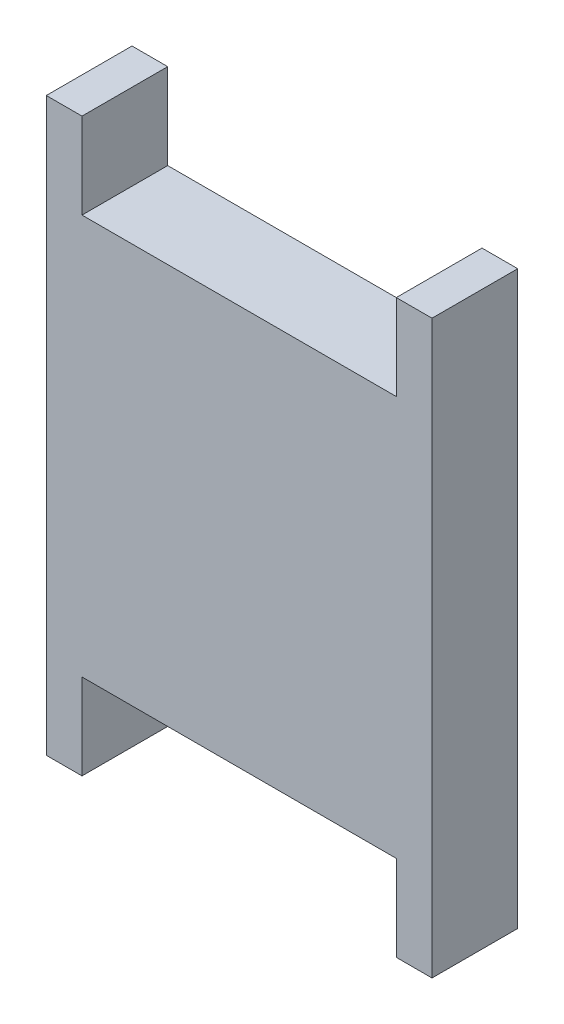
ISO-10303-21;
HEADER;
FILE_DESCRIPTION(('STEP AP214'),'2;1');
FILE_NAME('part.step','',(''),(''),'','','');
FILE_SCHEMA(('AUTOMOTIVE_DESIGN { 1 0 10303 214 1 1 1 1 }'));
ENDSEC;
DATA;
#1=APPLICATION_CONTEXT('core data for automotive mechanical design processes');
#2=APPLICATION_PROTOCOL_DEFINITION('international standard','automotive_design',2000,#1);
#3=PRODUCT_CONTEXT('',#1,'mechanical');
#4=PRODUCT('Part','Part','',(#3));
#5=PRODUCT_RELATED_PRODUCT_CATEGORY('part','',(#4));
#6=PRODUCT_DEFINITION_FORMATION('','',#4);
#7=PRODUCT_DEFINITION_CONTEXT('part definition',#1,'design');
#8=PRODUCT_DEFINITION('design','',#6,#7);
#9=PRODUCT_DEFINITION_SHAPE('','',#8);
#10=(LENGTH_UNIT() NAMED_UNIT(*) SI_UNIT(.MILLI.,.METRE.));
#11=(NAMED_UNIT(*) PLANE_ANGLE_UNIT() SI_UNIT($,.RADIAN.));
#12=(NAMED_UNIT(*) SI_UNIT($,.STERADIAN.) SOLID_ANGLE_UNIT());
#13=UNCERTAINTY_MEASURE_WITH_UNIT(LENGTH_MEASURE(1.E-05),#10,'distance_accuracy_value','');
#14=(GEOMETRIC_REPRESENTATION_CONTEXT(3) GLOBAL_UNCERTAINTY_ASSIGNED_CONTEXT((#13)) GLOBAL_UNIT_ASSIGNED_CONTEXT((#10,
#11,#12)) REPRESENTATION_CONTEXT('',''));
#15=CARTESIAN_POINT('',(0.,0.,0.));
#16=DIRECTION('',(0.,0.,1.));
#17=DIRECTION('',(1.,0.,0.));
#18=AXIS2_PLACEMENT_3D('',#15,#16,#17);
#19=CARTESIAN_POINT('',(42.8625,0.,19.05));
#20=DIRECTION('',(0.,1.,0.));
#21=DIRECTION('',(0.,0.,1.));
#22=AXIS2_PLACEMENT_3D('',#19,#20,#21);
#23=PLANE('',#22);
#24=DIRECTION('',(1.,0.,0.));
#25=VECTOR('',#24,1.);
#26=CARTESIAN_POINT('',(42.8625,0.,0.));
#27=LINE('',#26,#25);
#28=CARTESIAN_POINT('',(7.9375,0.,0.));
#29=VERTEX_POINT('',#28);
#30=CARTESIAN_POINT('',(77.7875,0.,0.));
#31=VERTEX_POINT('',#30);
#32=EDGE_CURVE('E154',#29,#31,#27,.T.);
#33=ORIENTED_EDGE('',*,*,#32,.T.);
#34=DIRECTION('',(0.,0.,-1.));
#35=VECTOR('',#34,1.);
#36=CARTESIAN_POINT('',(77.7875,0.,19.05));
#37=LINE('',#36,#35);
#38=CARTESIAN_POINT('',(77.7875,0.,19.05));
#39=VERTEX_POINT('',#38);
#40=EDGE_CURVE('E11',#39,#31,#37,.T.);
#41=ORIENTED_EDGE('',*,*,#40,.F.);
#42=DIRECTION('',(1.,0.,0.));
#43=VECTOR('',#42,1.);
#44=CARTESIAN_POINT('',(42.8625,0.,19.05));
#45=LINE('',#44,#43);
#46=CARTESIAN_POINT('',(7.9375,0.,19.05));
#47=VERTEX_POINT('',#46);
#48=EDGE_CURVE('E100',#47,#39,#45,.T.);
#49=ORIENTED_EDGE('',*,*,#48,.F.);
#50=DIRECTION('',(0.,0.,-1.));
#51=VECTOR('',#50,1.);
#52=CARTESIAN_POINT('',(7.9375,0.,19.05));
#53=LINE('',#52,#51);
#54=EDGE_CURVE('E153',#47,#29,#53,.T.);
#55=ORIENTED_EDGE('',*,*,#54,.T.);
#56=EDGE_LOOP('',(#33,#41,#49,#55));
#57=FACE_BOUND('',#56,.T.);
#58=ADVANCED_FACE('F33',(#57),#23,.F.);
#59=CARTESIAN_POINT('',(77.7875,-74.8721842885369,19.05));
#60=DIRECTION('',(-1.,0.,0.));
#61=DIRECTION('',(0.,0.,1.));
#62=AXIS2_PLACEMENT_3D('',#59,#60,#61);
#63=PLANE('',#62);
#64=DIRECTION('',(0.,1.,0.));
#65=VECTOR('',#64,1.);
#66=CARTESIAN_POINT('',(77.7875,-74.8721842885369,0.));
#67=LINE('',#66,#65);
#68=CARTESIAN_POINT('',(77.7875,-19.05,0.));
#69=VERTEX_POINT('',#68);
#70=EDGE_CURVE('E157',#69,#31,#67,.T.);
#71=ORIENTED_EDGE('',*,*,#70,.F.);
#72=DIRECTION('',(0.,0.,-1.));
#73=VECTOR('',#72,1.);
#74=CARTESIAN_POINT('',(77.7875,-19.05,19.05));
#75=LINE('',#74,#73);
#76=CARTESIAN_POINT('',(77.7875,-19.05,19.05));
#77=VERTEX_POINT('',#76);
#78=EDGE_CURVE('E41',#77,#69,#75,.T.);
#79=ORIENTED_EDGE('',*,*,#78,.F.);
#80=DIRECTION('',(0.,1.,0.));
#81=VECTOR('',#80,1.);
#82=CARTESIAN_POINT('',(77.7875,-74.8721842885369,19.05));
#83=LINE('',#82,#81);
#84=EDGE_CURVE('E413',#77,#39,#83,.T.);
#85=ORIENTED_EDGE('',*,*,#84,.T.);
#86=ORIENTED_EDGE('',*,*,#40,.T.);
#87=EDGE_LOOP('',(#71,#79,#85,#86));
#88=FACE_BOUND('',#87,.T.);
#89=ADVANCED_FACE('F207',(#88),#63,.T.);
#90=CARTESIAN_POINT('',(42.8625,-19.05,19.05));
#91=DIRECTION('',(0.,-1.,0.));
#92=DIRECTION('',(0.,0.,-1.));
#93=AXIS2_PLACEMENT_3D('',#90,#91,#92);
#94=PLANE('',#93);
#95=DIRECTION('',(-1.,0.,0.));
#96=VECTOR('',#95,1.);
#97=CARTESIAN_POINT('',(42.8625,-19.05,0.));
#98=LINE('',#97,#96);
#99=CARTESIAN_POINT('',(85.725,-19.05,0.));
#100=VERTEX_POINT('',#99);
#101=EDGE_CURVE('E160',#100,#69,#98,.T.);
#102=ORIENTED_EDGE('',*,*,#101,.F.);
#103=DIRECTION('',(0.,0.,-1.));
#104=VECTOR('',#103,1.);
#105=CARTESIAN_POINT('',(85.725,-19.05,19.05));
#106=LINE('',#105,#104);
#107=CARTESIAN_POINT('',(85.725,-19.05,19.05));
#108=VERTEX_POINT('',#107);
#109=EDGE_CURVE('E197',#108,#100,#106,.T.);
#110=ORIENTED_EDGE('',*,*,#109,.F.);
#111=DIRECTION('',(-1.,0.,0.));
#112=VECTOR('',#111,1.);
#113=CARTESIAN_POINT('',(42.8625,-19.05,19.05));
#114=LINE('',#113,#112);
#115=EDGE_CURVE('E204',#108,#77,#114,.T.);
#116=ORIENTED_EDGE('',*,*,#115,.T.);
#117=ORIENTED_EDGE('',*,*,#78,.T.);
#118=EDGE_LOOP('',(#102,#110,#116,#117));
#119=FACE_BOUND('',#118,.T.);
#120=ADVANCED_FACE('F202',(#119),#94,.T.);
#121=CARTESIAN_POINT('',(85.725,-74.8721842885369,19.05));
#122=DIRECTION('',(-1.,0.,0.));
#123=DIRECTION('',(0.,0.,1.));
#124=AXIS2_PLACEMENT_3D('',#121,#122,#123);
#125=PLANE('',#124);
#126=DIRECTION('',(0.,1.,0.));
#127=VECTOR('',#126,1.);
#128=CARTESIAN_POINT('',(85.725,-74.8721842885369,0.));
#129=LINE('',#128,#127);
#130=CARTESIAN_POINT('',(85.725,107.95,0.));
#131=VERTEX_POINT('',#130);
#132=EDGE_CURVE('E163',#100,#131,#129,.T.);
#133=ORIENTED_EDGE('',*,*,#132,.T.);
#134=DIRECTION('',(0.,0.,-1.));
#135=VECTOR('',#134,1.);
#136=CARTESIAN_POINT('',(85.725,107.95,19.05));
#137=LINE('',#136,#135);
#138=CARTESIAN_POINT('',(85.725,107.95,19.05));
#139=VERTEX_POINT('',#138);
#140=EDGE_CURVE('E194',#139,#131,#137,.T.);
#141=ORIENTED_EDGE('',*,*,#140,.F.);
#142=DIRECTION('',(0.,1.,0.));
#143=VECTOR('',#142,1.);
#144=CARTESIAN_POINT('',(85.725,-74.8721842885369,19.05));
#145=LINE('',#144,#143);
#146=EDGE_CURVE('E225',#108,#139,#145,.T.);
#147=ORIENTED_EDGE('',*,*,#146,.F.);
#148=ORIENTED_EDGE('',*,*,#109,.T.);
#149=EDGE_LOOP('',(#133,#141,#147,#148));
#150=FACE_BOUND('',#149,.T.);
#151=ADVANCED_FACE('F216',(#150),#125,.F.);
#152=CARTESIAN_POINT('',(42.8625,107.95,19.05));
#153=DIRECTION('',(0.,-1.,0.));
#154=DIRECTION('',(0.,0.,-1.));
#155=AXIS2_PLACEMENT_3D('',#152,#153,#154);
#156=PLANE('',#155);
#157=DIRECTION('',(-1.,0.,0.));
#158=VECTOR('',#157,1.);
#159=CARTESIAN_POINT('',(42.8625,107.95,0.));
#160=LINE('',#159,#158);
#161=CARTESIAN_POINT('',(77.7875,107.95,0.));
#162=VERTEX_POINT('',#161);
#163=EDGE_CURVE('E165',#131,#162,#160,.T.);
#164=ORIENTED_EDGE('',*,*,#163,.T.);
#165=DIRECTION('',(0.,0.,-1.));
#166=VECTOR('',#165,1.);
#167=CARTESIAN_POINT('',(77.7875,107.95,19.05));
#168=LINE('',#167,#166);
#169=CARTESIAN_POINT('',(77.7875,107.95,19.05));
#170=VERTEX_POINT('',#169);
#171=EDGE_CURVE('E191',#170,#162,#168,.T.);
#172=ORIENTED_EDGE('',*,*,#171,.F.);
#173=DIRECTION('',(-1.,0.,0.));
#174=VECTOR('',#173,1.);
#175=CARTESIAN_POINT('',(42.8625,107.95,19.05));
#176=LINE('',#175,#174);
#177=EDGE_CURVE('E222',#139,#170,#176,.T.);
#178=ORIENTED_EDGE('',*,*,#177,.F.);
#179=ORIENTED_EDGE('',*,*,#140,.T.);
#180=EDGE_LOOP('',(#164,#172,#178,#179));
#181=FACE_BOUND('',#180,.T.);
#182=ADVANCED_FACE('F220',(#181),#156,.F.);
#183=CARTESIAN_POINT('',(77.7875,-74.8721842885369,19.05));
#184=DIRECTION('',(1.,0.,0.));
#185=DIRECTION('',(0.,0.,-1.));
#186=AXIS2_PLACEMENT_3D('',#183,#184,#185);
#187=PLANE('',#186);
#188=DIRECTION('',(0.,-1.,0.));
#189=VECTOR('',#188,1.);
#190=CARTESIAN_POINT('',(77.7875,-74.8721842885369,0.));
#191=LINE('',#190,#189);
#192=CARTESIAN_POINT('',(77.7875,88.9,0.));
#193=VERTEX_POINT('',#192);
#194=EDGE_CURVE('E167',#162,#193,#191,.T.);
#195=ORIENTED_EDGE('',*,*,#194,.T.);
#196=DIRECTION('',(0.,0.,-1.));
#197=VECTOR('',#196,1.);
#198=CARTESIAN_POINT('',(77.7875,88.9,19.05));
#199=LINE('',#198,#197);
#200=CARTESIAN_POINT('',(77.7875,88.9,19.05));
#201=VERTEX_POINT('',#200);
#202=EDGE_CURVE('E189',#201,#193,#199,.T.);
#203=ORIENTED_EDGE('',*,*,#202,.F.);
#204=DIRECTION('',(0.,-1.,0.));
#205=VECTOR('',#204,1.);
#206=CARTESIAN_POINT('',(77.7875,-74.8721842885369,19.05));
#207=LINE('',#206,#205);
#208=EDGE_CURVE('E224',#170,#201,#207,.T.);
#209=ORIENTED_EDGE('',*,*,#208,.F.);
#210=ORIENTED_EDGE('',*,*,#171,.T.);
#211=EDGE_LOOP('',(#195,#203,#209,#210));
#212=FACE_BOUND('',#211,.T.);
#213=ADVANCED_FACE('F266',(#212),#187,.F.);
#214=CARTESIAN_POINT('',(42.8625,88.9,19.05));
#215=DIRECTION('',(0.,1.,0.));
#216=DIRECTION('',(0.,0.,1.));
#217=AXIS2_PLACEMENT_3D('',#214,#215,#216);
#218=PLANE('',#217);
#219=DIRECTION('',(1.,0.,0.));
#220=VECTOR('',#219,1.);
#221=CARTESIAN_POINT('',(42.8625,88.9,0.));
#222=LINE('',#221,#220);
#223=CARTESIAN_POINT('',(7.9375,88.9,0.));
#224=VERTEX_POINT('',#223);
#225=EDGE_CURVE('E170',#224,#193,#222,.T.);
#226=ORIENTED_EDGE('',*,*,#225,.F.);
#227=DIRECTION('',(0.,0.,-1.));
#228=VECTOR('',#227,1.);
#229=CARTESIAN_POINT('',(7.9375,88.9,19.05));
#230=LINE('',#229,#228);
#231=CARTESIAN_POINT('',(7.9375,88.9,19.05));
#232=VERTEX_POINT('',#231);
#233=EDGE_CURVE('E187',#232,#224,#230,.T.);
#234=ORIENTED_EDGE('',*,*,#233,.F.);
#235=DIRECTION('',(1.,0.,0.));
#236=VECTOR('',#235,1.);
#237=CARTESIAN_POINT('',(42.8625,88.9,19.05));
#238=LINE('',#237,#236);
#239=EDGE_CURVE('E227',#232,#201,#238,.T.);
#240=ORIENTED_EDGE('',*,*,#239,.T.);
#241=ORIENTED_EDGE('',*,*,#202,.T.);
#242=EDGE_LOOP('',(#226,#234,#240,#241));
#243=FACE_BOUND('',#242,.T.);
#244=ADVANCED_FACE('F269',(#243),#218,.T.);
#245=CARTESIAN_POINT('',(7.9375,-74.8721842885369,19.05));
#246=DIRECTION('',(1.,0.,0.));
#247=DIRECTION('',(0.,0.,-1.));
#248=AXIS2_PLACEMENT_3D('',#245,#246,#247);
#249=PLANE('',#248);
#250=DIRECTION('',(0.,-1.,0.));
#251=VECTOR('',#250,1.);
#252=CARTESIAN_POINT('',(7.9375,-74.8721842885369,0.));
#253=LINE('',#252,#251);
#254=CARTESIAN_POINT('',(7.9375,107.95,0.));
#255=VERTEX_POINT('',#254);
#256=EDGE_CURVE('E173',#255,#224,#253,.T.);
#257=ORIENTED_EDGE('',*,*,#256,.F.);
#258=DIRECTION('',(0.,0.,-1.));
#259=VECTOR('',#258,1.);
#260=CARTESIAN_POINT('',(7.9375,107.95,19.05));
#261=LINE('',#260,#259);
#262=CARTESIAN_POINT('',(7.9375,107.95,19.05));
#263=VERTEX_POINT('',#262);
#264=EDGE_CURVE('E185',#263,#255,#261,.T.);
#265=ORIENTED_EDGE('',*,*,#264,.F.);
#266=DIRECTION('',(0.,-1.,0.));
#267=VECTOR('',#266,1.);
#268=CARTESIAN_POINT('',(7.9375,-74.8721842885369,19.05));
#269=LINE('',#268,#267);
#270=EDGE_CURVE('E148',#263,#232,#269,.T.);
#271=ORIENTED_EDGE('',*,*,#270,.T.);
#272=ORIENTED_EDGE('',*,*,#233,.T.);
#273=EDGE_LOOP('',(#257,#265,#271,#272));
#274=FACE_BOUND('',#273,.T.);
#275=ADVANCED_FACE('F236',(#274),#249,.T.);
#276=CARTESIAN_POINT('',(42.8625,107.95,19.05));
#277=DIRECTION('',(0.,1.,0.));
#278=DIRECTION('',(0.,0.,1.));
#279=AXIS2_PLACEMENT_3D('',#276,#277,#278);
#280=PLANE('',#279);
#281=DIRECTION('',(1.,0.,0.));
#282=VECTOR('',#281,1.);
#283=CARTESIAN_POINT('',(42.8625,107.95,0.));
#284=LINE('',#283,#282);
#285=CARTESIAN_POINT('',(0.,107.95,0.));
#286=VERTEX_POINT('',#285);
#287=EDGE_CURVE('E176',#286,#255,#284,.T.);
#288=ORIENTED_EDGE('',*,*,#287,.F.);
#289=DIRECTION('',(0.,0.,-1.));
#290=VECTOR('',#289,1.);
#291=CARTESIAN_POINT('',(0.,107.95,19.05));
#292=LINE('',#291,#290);
#293=CARTESIAN_POINT('',(0.,107.95,19.05));
#294=VERTEX_POINT('',#293);
#295=EDGE_CURVE('E136',#294,#286,#292,.T.);
#296=ORIENTED_EDGE('',*,*,#295,.F.);
#297=DIRECTION('',(1.,0.,0.));
#298=VECTOR('',#297,1.);
#299=CARTESIAN_POINT('',(42.8625,107.95,19.05));
#300=LINE('',#299,#298);
#301=EDGE_CURVE('E146',#294,#263,#300,.T.);
#302=ORIENTED_EDGE('',*,*,#301,.T.);
#303=ORIENTED_EDGE('',*,*,#264,.T.);
#304=EDGE_LOOP('',(#288,#296,#302,#303));
#305=FACE_BOUND('',#304,.T.);
#306=ADVANCED_FACE('F241',(#305),#280,.T.);
#307=CARTESIAN_POINT('',(0.,-74.8721842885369,19.05));
#308=DIRECTION('',(-1.,0.,0.));
#309=DIRECTION('',(0.,0.,1.));
#310=AXIS2_PLACEMENT_3D('',#307,#308,#309);
#311=PLANE('',#310);
#312=DIRECTION('',(0.,1.,0.));
#313=VECTOR('',#312,1.);
#314=CARTESIAN_POINT('',(0.,-74.8721842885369,0.));
#315=LINE('',#314,#313);
#316=CARTESIAN_POINT('',(0.,-19.05,0.));
#317=VERTEX_POINT('',#316);
#318=EDGE_CURVE('E135',#317,#286,#315,.T.);
#319=ORIENTED_EDGE('',*,*,#318,.F.);
#320=DIRECTION('',(0.,0.,-1.));
#321=VECTOR('',#320,1.);
#322=CARTESIAN_POINT('',(0.,-19.05,19.05));
#323=LINE('',#322,#321);
#324=CARTESIAN_POINT('',(0.,-19.05,19.05));
#325=VERTEX_POINT('',#324);
#326=EDGE_CURVE('E129',#325,#317,#323,.T.);
#327=ORIENTED_EDGE('',*,*,#326,.F.);
#328=DIRECTION('',(0.,1.,0.));
#329=VECTOR('',#328,1.);
#330=CARTESIAN_POINT('',(0.,-74.8721842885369,19.05));
#331=LINE('',#330,#329);
#332=EDGE_CURVE('E133',#325,#294,#331,.T.);
#333=ORIENTED_EDGE('',*,*,#332,.T.);
#334=ORIENTED_EDGE('',*,*,#295,.T.);
#335=EDGE_LOOP('',(#319,#327,#333,#334));
#336=FACE_BOUND('',#335,.T.);
#337=ADVANCED_FACE('F131',(#336),#311,.T.);
#338=CARTESIAN_POINT('',(42.8625,-19.05,19.05));
#339=DIRECTION('',(0.,1.,0.));
#340=DIRECTION('',(0.,0.,1.));
#341=AXIS2_PLACEMENT_3D('',#338,#339,#340);
#342=PLANE('',#341);
#343=DIRECTION('',(1.,0.,0.));
#344=VECTOR('',#343,1.);
#345=CARTESIAN_POINT('',(42.8625,-19.05,0.));
#346=LINE('',#345,#344);
#347=CARTESIAN_POINT('',(7.9375,-19.05,0.));
#348=VERTEX_POINT('',#347);
#349=EDGE_CURVE('E88',#317,#348,#346,.T.);
#350=ORIENTED_EDGE('',*,*,#349,.T.);
#351=DIRECTION('',(0.,0.,-1.));
#352=VECTOR('',#351,1.);
#353=CARTESIAN_POINT('',(7.9375,-19.05,19.05));
#354=LINE('',#353,#352);
#355=CARTESIAN_POINT('',(7.9375,-19.05,19.05));
#356=VERTEX_POINT('',#355);
#357=EDGE_CURVE('E137',#356,#348,#354,.T.);
#358=ORIENTED_EDGE('',*,*,#357,.F.);
#359=DIRECTION('',(1.,0.,0.));
#360=VECTOR('',#359,1.);
#361=CARTESIAN_POINT('',(42.8625,-19.05,19.05));
#362=LINE('',#361,#360);
#363=EDGE_CURVE('E139',#325,#356,#362,.T.);
#364=ORIENTED_EDGE('',*,*,#363,.F.);
#365=ORIENTED_EDGE('',*,*,#326,.T.);
#366=EDGE_LOOP('',(#350,#358,#364,#365));
#367=FACE_BOUND('',#366,.T.);
#368=ADVANCED_FACE('F140',(#367),#342,.F.);
#369=CARTESIAN_POINT('',(7.9375,-74.8721842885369,19.05));
#370=DIRECTION('',(-1.,0.,0.));
#371=DIRECTION('',(0.,0.,1.));
#372=AXIS2_PLACEMENT_3D('',#369,#370,#371);
#373=PLANE('',#372);
#374=DIRECTION('',(0.,1.,0.));
#375=VECTOR('',#374,1.);
#376=CARTESIAN_POINT('',(7.9375,-74.8721842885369,0.));
#377=LINE('',#376,#375);
#378=EDGE_CURVE('E94',#348,#29,#377,.T.);
#379=ORIENTED_EDGE('',*,*,#378,.T.);
#380=ORIENTED_EDGE('',*,*,#54,.F.);
#381=DIRECTION('',(0.,1.,0.));
#382=VECTOR('',#381,1.);
#383=CARTESIAN_POINT('',(7.9375,-74.8721842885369,19.05));
#384=LINE('',#383,#382);
#385=EDGE_CURVE('E49',#356,#47,#384,.T.);
#386=ORIENTED_EDGE('',*,*,#385,.F.);
#387=ORIENTED_EDGE('',*,*,#357,.T.);
#388=EDGE_LOOP('',(#379,#380,#386,#387));
#389=FACE_BOUND('',#388,.T.);
#390=ADVANCED_FACE('F243',(#389),#373,.F.);
#391=CARTESIAN_POINT('',(42.8625,-74.8721842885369,19.05));
#392=DIRECTION('',(0.,0.,1.));
#393=DIRECTION('',(1.,0.,0.));
#394=AXIS2_PLACEMENT_3D('',#391,#392,#393);
#395=PLANE('',#394);
#396=ORIENTED_EDGE('',*,*,#48,.T.);
#397=ORIENTED_EDGE('',*,*,#84,.F.);
#398=ORIENTED_EDGE('',*,*,#115,.F.);
#399=ORIENTED_EDGE('',*,*,#146,.T.);
#400=ORIENTED_EDGE('',*,*,#177,.T.);
#401=ORIENTED_EDGE('',*,*,#208,.T.);
#402=ORIENTED_EDGE('',*,*,#239,.F.);
#403=ORIENTED_EDGE('',*,*,#270,.F.);
#404=ORIENTED_EDGE('',*,*,#301,.F.);
#405=ORIENTED_EDGE('',*,*,#332,.F.);
#406=ORIENTED_EDGE('',*,*,#363,.T.);
#407=ORIENTED_EDGE('',*,*,#385,.T.);
#408=EDGE_LOOP('',(#396,#397,#398,#399,#400,#401,#402,#403,#404,#405,#406,#407));
#409=FACE_BOUND('',#408,.T.);
#410=ADVANCED_FACE('F143',(#409),#395,.T.);
#411=CARTESIAN_POINT('',(42.8625,-74.8721842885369,0.));
#412=DIRECTION('',(0.,0.,1.));
#413=DIRECTION('',(1.,0.,0.));
#414=AXIS2_PLACEMENT_3D('',#411,#412,#413);
#415=PLANE('',#414);
#416=ORIENTED_EDGE('',*,*,#32,.F.);
#417=ORIENTED_EDGE('',*,*,#378,.F.);
#418=ORIENTED_EDGE('',*,*,#349,.F.);
#419=ORIENTED_EDGE('',*,*,#318,.T.);
#420=ORIENTED_EDGE('',*,*,#287,.T.);
#421=ORIENTED_EDGE('',*,*,#256,.T.);
#422=ORIENTED_EDGE('',*,*,#225,.T.);
#423=ORIENTED_EDGE('',*,*,#194,.F.);
#424=ORIENTED_EDGE('',*,*,#163,.F.);
#425=ORIENTED_EDGE('',*,*,#132,.F.);
#426=ORIENTED_EDGE('',*,*,#101,.T.);
#427=ORIENTED_EDGE('',*,*,#70,.T.);
#428=EDGE_LOOP('',(#416,#417,#418,#419,#420,#421,#422,#423,#424,#425,#426,#427));
#429=FACE_BOUND('',#428,.T.);
#430=ADVANCED_FACE('F211',(#429),#415,.F.);
#431=CLOSED_SHELL('',(#58,#89,#120,#151,#182,#213,#244,#275,#306,#337,#368,#390,#410,#430));
#432=MANIFOLD_SOLID_BREP('B2',#431);
#433=ADVANCED_BREP_SHAPE_REPRESENTATION('',(#18,#432),#14);
#434=SHAPE_DEFINITION_REPRESENTATION(#9,#433);
ENDSEC;
END-ISO-10303-21;
